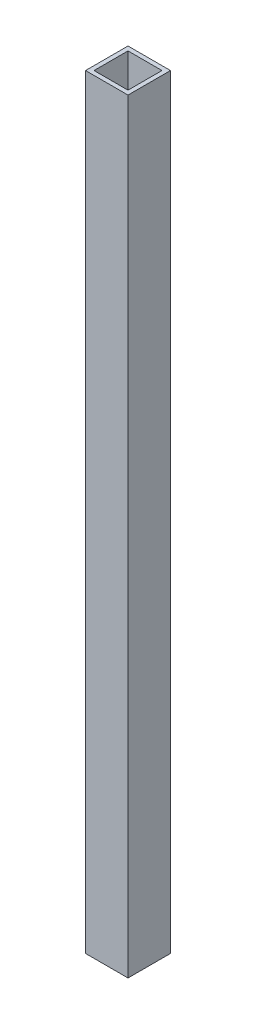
ISO-10303-21;
HEADER;
FILE_DESCRIPTION(('STEP AP214'),'2;1');
FILE_NAME('part.step','',(''),(''),'','','');
FILE_SCHEMA(('AUTOMOTIVE_DESIGN { 1 0 10303 214 1 1 1 1 }'));
ENDSEC;
DATA;
#1=APPLICATION_CONTEXT('core data for automotive mechanical design processes');
#2=APPLICATION_PROTOCOL_DEFINITION('international standard','automotive_design',2000,#1);
#3=PRODUCT_CONTEXT('',#1,'mechanical');
#4=PRODUCT('Part','Part','',(#3));
#5=PRODUCT_RELATED_PRODUCT_CATEGORY('part','',(#4));
#6=PRODUCT_DEFINITION_FORMATION('','',#4);
#7=PRODUCT_DEFINITION_CONTEXT('part definition',#1,'design');
#8=PRODUCT_DEFINITION('design','',#6,#7);
#9=PRODUCT_DEFINITION_SHAPE('','',#8);
#10=(LENGTH_UNIT() NAMED_UNIT(*) SI_UNIT(.MILLI.,.METRE.));
#11=(NAMED_UNIT(*) PLANE_ANGLE_UNIT() SI_UNIT($,.RADIAN.));
#12=(NAMED_UNIT(*) SI_UNIT($,.STERADIAN.) SOLID_ANGLE_UNIT());
#13=UNCERTAINTY_MEASURE_WITH_UNIT(LENGTH_MEASURE(1.E-05),#10,'distance_accuracy_value','');
#14=(GEOMETRIC_REPRESENTATION_CONTEXT(3) GLOBAL_UNCERTAINTY_ASSIGNED_CONTEXT((#13)) GLOBAL_UNIT_ASSIGNED_CONTEXT((#10,
#11,#12)) REPRESENTATION_CONTEXT('',''));
#15=CARTESIAN_POINT('',(0.,0.,0.));
#16=DIRECTION('',(0.,0.,1.));
#17=DIRECTION('',(1.,0.,0.));
#18=AXIS2_PLACEMENT_3D('',#15,#16,#17);
#19=CARTESIAN_POINT('',(0.,180.,0.));
#20=DIRECTION('',(0.,1.,0.));
#21=DIRECTION('',(0.,0.,1.));
#22=AXIS2_PLACEMENT_3D('',#19,#20,#21);
#23=PLANE('',#22);
#24=DIRECTION('',(0.,0.,-1.));
#25=VECTOR('',#24,1.);
#26=CARTESIAN_POINT('',(5.,180.,-5.));
#27=LINE('',#26,#25);
#28=CARTESIAN_POINT('',(5.,180.,5.));
#29=VERTEX_POINT('',#28);
#30=CARTESIAN_POINT('',(5.,180.,-5.));
#31=VERTEX_POINT('',#30);
#32=EDGE_CURVE('E133',#29,#31,#27,.T.);
#33=ORIENTED_EDGE('',*,*,#32,.T.);
#34=DIRECTION('',(-1.,0.,0.));
#35=VECTOR('',#34,1.);
#36=CARTESIAN_POINT('',(-5.,180.,-5.));
#37=LINE('',#36,#35);
#38=CARTESIAN_POINT('',(-5.,180.,-5.));
#39=VERTEX_POINT('',#38);
#40=EDGE_CURVE('E136',#31,#39,#37,.T.);
#41=ORIENTED_EDGE('',*,*,#40,.T.);
#42=DIRECTION('',(0.,0.,1.));
#43=VECTOR('',#42,1.);
#44=CARTESIAN_POINT('',(-5.,180.,-5.));
#45=LINE('',#44,#43);
#46=CARTESIAN_POINT('',(-5.,180.,5.));
#47=VERTEX_POINT('',#46);
#48=EDGE_CURVE('E139',#39,#47,#45,.T.);
#49=ORIENTED_EDGE('',*,*,#48,.T.);
#50=DIRECTION('',(1.,0.,0.));
#51=VECTOR('',#50,1.);
#52=CARTESIAN_POINT('',(-5.,180.,5.));
#53=LINE('',#52,#51);
#54=EDGE_CURVE('E141',#47,#29,#53,.T.);
#55=ORIENTED_EDGE('',*,*,#54,.T.);
#56=EDGE_LOOP('',(#33,#41,#49,#55));
#57=FACE_BOUND('',#56,.T.);
#58=DIRECTION('',(-1.,0.,0.));
#59=VECTOR('',#58,1.);
#60=CARTESIAN_POINT('',(-4.,180.,-4.));
#61=LINE('',#60,#59);
#62=CARTESIAN_POINT('',(4.,180.,-4.));
#63=VERTEX_POINT('',#62);
#64=CARTESIAN_POINT('',(-4.,180.,-4.));
#65=VERTEX_POINT('',#64);
#66=EDGE_CURVE('E105',#63,#65,#61,.T.);
#67=ORIENTED_EDGE('',*,*,#66,.F.);
#68=DIRECTION('',(0.,0.,-1.));
#69=VECTOR('',#68,1.);
#70=CARTESIAN_POINT('',(4.,180.,-4.));
#71=LINE('',#70,#69);
#72=CARTESIAN_POINT('',(4.,180.,4.));
#73=VERTEX_POINT('',#72);
#74=EDGE_CURVE('E97',#73,#63,#71,.T.);
#75=ORIENTED_EDGE('',*,*,#74,.F.);
#76=DIRECTION('',(1.,0.,0.));
#77=VECTOR('',#76,1.);
#78=CARTESIAN_POINT('',(-4.,180.,4.));
#79=LINE('',#78,#77);
#80=CARTESIAN_POINT('',(-4.,180.,4.));
#81=VERTEX_POINT('',#80);
#82=EDGE_CURVE('E119',#81,#73,#79,.T.);
#83=ORIENTED_EDGE('',*,*,#82,.F.);
#84=DIRECTION('',(0.,0.,1.));
#85=VECTOR('',#84,1.);
#86=CARTESIAN_POINT('',(-4.,180.,-4.));
#87=LINE('',#86,#85);
#88=EDGE_CURVE('E117',#65,#81,#87,.T.);
#89=ORIENTED_EDGE('',*,*,#88,.F.);
#90=EDGE_LOOP('',(#67,#75,#83,#89));
#91=FACE_BOUND('',#90,.T.);
#92=ADVANCED_FACE('F32',(#57,#91),#23,.T.);
#93=CARTESIAN_POINT('',(0.,0.,0.));
#94=DIRECTION('',(0.,1.,0.));
#95=DIRECTION('',(0.,0.,1.));
#96=AXIS2_PLACEMENT_3D('',#93,#94,#95);
#97=PLANE('',#96);
#98=DIRECTION('',(0.,0.,-1.));
#99=VECTOR('',#98,1.);
#100=CARTESIAN_POINT('',(5.,0.,-5.));
#101=LINE('',#100,#99);
#102=CARTESIAN_POINT('',(5.,0.,5.));
#103=VERTEX_POINT('',#102);
#104=CARTESIAN_POINT('',(5.,0.,-5.));
#105=VERTEX_POINT('',#104);
#106=EDGE_CURVE('E113',#103,#105,#101,.T.);
#107=ORIENTED_EDGE('',*,*,#106,.F.);
#108=DIRECTION('',(1.,0.,0.));
#109=VECTOR('',#108,1.);
#110=CARTESIAN_POINT('',(-5.,0.,5.));
#111=LINE('',#110,#109);
#112=CARTESIAN_POINT('',(-5.,0.,5.));
#113=VERTEX_POINT('',#112);
#114=EDGE_CURVE('E137',#113,#103,#111,.T.);
#115=ORIENTED_EDGE('',*,*,#114,.F.);
#116=DIRECTION('',(0.,0.,1.));
#117=VECTOR('',#116,1.);
#118=CARTESIAN_POINT('',(-5.,0.,-5.));
#119=LINE('',#118,#117);
#120=CARTESIAN_POINT('',(-5.,0.,-5.));
#121=VERTEX_POINT('',#120);
#122=EDGE_CURVE('E148',#121,#113,#119,.T.);
#123=ORIENTED_EDGE('',*,*,#122,.F.);
#124=DIRECTION('',(-1.,0.,0.));
#125=VECTOR('',#124,1.);
#126=CARTESIAN_POINT('',(-5.,0.,-5.));
#127=LINE('',#126,#125);
#128=EDGE_CURVE('E146',#105,#121,#127,.T.);
#129=ORIENTED_EDGE('',*,*,#128,.F.);
#130=EDGE_LOOP('',(#107,#115,#123,#129));
#131=FACE_BOUND('',#130,.T.);
#132=DIRECTION('',(0.,0.,-1.));
#133=VECTOR('',#132,1.);
#134=CARTESIAN_POINT('',(4.,0.,-4.));
#135=LINE('',#134,#133);
#136=CARTESIAN_POINT('',(4.,0.,4.));
#137=VERTEX_POINT('',#136);
#138=CARTESIAN_POINT('',(4.,0.,-4.));
#139=VERTEX_POINT('',#138);
#140=EDGE_CURVE('E55',#137,#139,#135,.T.);
#141=ORIENTED_EDGE('',*,*,#140,.T.);
#142=DIRECTION('',(-1.,0.,0.));
#143=VECTOR('',#142,1.);
#144=CARTESIAN_POINT('',(-4.,0.,-4.));
#145=LINE('',#144,#143);
#146=CARTESIAN_POINT('',(-4.,0.,-4.));
#147=VERTEX_POINT('',#146);
#148=EDGE_CURVE('E112',#139,#147,#145,.T.);
#149=ORIENTED_EDGE('',*,*,#148,.T.);
#150=DIRECTION('',(0.,0.,1.));
#151=VECTOR('',#150,1.);
#152=CARTESIAN_POINT('',(-4.,0.,-4.));
#153=LINE('',#152,#151);
#154=CARTESIAN_POINT('',(-4.,0.,4.));
#155=VERTEX_POINT('',#154);
#156=EDGE_CURVE('E125',#147,#155,#153,.T.);
#157=ORIENTED_EDGE('',*,*,#156,.T.);
#158=DIRECTION('',(1.,0.,0.));
#159=VECTOR('',#158,1.);
#160=CARTESIAN_POINT('',(-4.,0.,4.));
#161=LINE('',#160,#159);
#162=EDGE_CURVE('E106',#155,#137,#161,.T.);
#163=ORIENTED_EDGE('',*,*,#162,.T.);
#164=EDGE_LOOP('',(#141,#149,#157,#163));
#165=FACE_BOUND('',#164,.T.);
#166=ADVANCED_FACE('F166',(#131,#165),#97,.F.);
#167=CARTESIAN_POINT('',(5.,180.,-5.));
#168=DIRECTION('',(-1.,0.,0.));
#169=DIRECTION('',(0.,0.,1.));
#170=AXIS2_PLACEMENT_3D('',#167,#168,#169);
#171=PLANE('',#170);
#172=ORIENTED_EDGE('',*,*,#106,.T.);
#173=DIRECTION('',(0.,-1.,0.));
#174=VECTOR('',#173,1.);
#175=CARTESIAN_POINT('',(5.,180.,-5.));
#176=LINE('',#175,#174);
#177=EDGE_CURVE('E11',#31,#105,#176,.T.);
#178=ORIENTED_EDGE('',*,*,#177,.F.);
#179=ORIENTED_EDGE('',*,*,#32,.F.);
#180=DIRECTION('',(0.,-1.,0.));
#181=VECTOR('',#180,1.);
#182=CARTESIAN_POINT('',(5.,180.,5.));
#183=LINE('',#182,#181);
#184=EDGE_CURVE('E143',#29,#103,#183,.T.);
#185=ORIENTED_EDGE('',*,*,#184,.T.);
#186=EDGE_LOOP('',(#172,#178,#179,#185));
#187=FACE_BOUND('',#186,.T.);
#188=ADVANCED_FACE('F34',(#187),#171,.F.);
#189=CARTESIAN_POINT('',(-5.,180.,-5.));
#190=DIRECTION('',(0.,0.,1.));
#191=DIRECTION('',(1.,0.,0.));
#192=AXIS2_PLACEMENT_3D('',#189,#190,#191);
#193=PLANE('',#192);
#194=ORIENTED_EDGE('',*,*,#128,.T.);
#195=DIRECTION('',(0.,-1.,0.));
#196=VECTOR('',#195,1.);
#197=CARTESIAN_POINT('',(-5.,180.,-5.));
#198=LINE('',#197,#196);
#199=EDGE_CURVE('E40',#39,#121,#198,.T.);
#200=ORIENTED_EDGE('',*,*,#199,.F.);
#201=ORIENTED_EDGE('',*,*,#40,.F.);
#202=ORIENTED_EDGE('',*,*,#177,.T.);
#203=EDGE_LOOP('',(#194,#200,#201,#202));
#204=FACE_BOUND('',#203,.T.);
#205=ADVANCED_FACE('F176',(#204),#193,.F.);
#206=CARTESIAN_POINT('',(-5.,180.,-5.));
#207=DIRECTION('',(1.,0.,0.));
#208=DIRECTION('',(0.,0.,-1.));
#209=AXIS2_PLACEMENT_3D('',#206,#207,#208);
#210=PLANE('',#209);
#211=ORIENTED_EDGE('',*,*,#122,.T.);
#212=DIRECTION('',(0.,-1.,0.));
#213=VECTOR('',#212,1.);
#214=CARTESIAN_POINT('',(-5.,180.,5.));
#215=LINE('',#214,#213);
#216=EDGE_CURVE('E153',#47,#113,#215,.T.);
#217=ORIENTED_EDGE('',*,*,#216,.F.);
#218=ORIENTED_EDGE('',*,*,#48,.F.);
#219=ORIENTED_EDGE('',*,*,#199,.T.);
#220=EDGE_LOOP('',(#211,#217,#218,#219));
#221=FACE_BOUND('',#220,.T.);
#222=ADVANCED_FACE('F160',(#221),#210,.F.);
#223=CARTESIAN_POINT('',(-5.,180.,5.));
#224=DIRECTION('',(0.,0.,-1.));
#225=DIRECTION('',(-1.,0.,0.));
#226=AXIS2_PLACEMENT_3D('',#223,#224,#225);
#227=PLANE('',#226);
#228=ORIENTED_EDGE('',*,*,#114,.T.);
#229=ORIENTED_EDGE('',*,*,#184,.F.);
#230=ORIENTED_EDGE('',*,*,#54,.F.);
#231=ORIENTED_EDGE('',*,*,#216,.T.);
#232=EDGE_LOOP('',(#228,#229,#230,#231));
#233=FACE_BOUND('',#232,.T.);
#234=ADVANCED_FACE('F170',(#233),#227,.F.);
#235=CARTESIAN_POINT('',(4.,180.,-4.));
#236=DIRECTION('',(-1.,0.,0.));
#237=DIRECTION('',(0.,0.,1.));
#238=AXIS2_PLACEMENT_3D('',#235,#236,#237);
#239=PLANE('',#238);
#240=ORIENTED_EDGE('',*,*,#140,.F.);
#241=DIRECTION('',(0.,-1.,0.));
#242=VECTOR('',#241,1.);
#243=CARTESIAN_POINT('',(4.,180.,4.));
#244=LINE('',#243,#242);
#245=EDGE_CURVE('E101',#73,#137,#244,.T.);
#246=ORIENTED_EDGE('',*,*,#245,.F.);
#247=ORIENTED_EDGE('',*,*,#74,.T.);
#248=DIRECTION('',(0.,-1.,0.));
#249=VECTOR('',#248,1.);
#250=CARTESIAN_POINT('',(4.,180.,-4.));
#251=LINE('',#250,#249);
#252=EDGE_CURVE('E100',#63,#139,#251,.T.);
#253=ORIENTED_EDGE('',*,*,#252,.T.);
#254=EDGE_LOOP('',(#240,#246,#247,#253));
#255=FACE_BOUND('',#254,.T.);
#256=ADVANCED_FACE('F99',(#255),#239,.T.);
#257=CARTESIAN_POINT('',(-4.,180.,-4.));
#258=DIRECTION('',(0.,0.,1.));
#259=DIRECTION('',(1.,0.,0.));
#260=AXIS2_PLACEMENT_3D('',#257,#258,#259);
#261=PLANE('',#260);
#262=ORIENTED_EDGE('',*,*,#148,.F.);
#263=ORIENTED_EDGE('',*,*,#252,.F.);
#264=ORIENTED_EDGE('',*,*,#66,.T.);
#265=DIRECTION('',(0.,-1.,0.));
#266=VECTOR('',#265,1.);
#267=CARTESIAN_POINT('',(-4.,180.,-4.));
#268=LINE('',#267,#266);
#269=EDGE_CURVE('E114',#65,#147,#268,.T.);
#270=ORIENTED_EDGE('',*,*,#269,.T.);
#271=EDGE_LOOP('',(#262,#263,#264,#270));
#272=FACE_BOUND('',#271,.T.);
#273=ADVANCED_FACE('F109',(#272),#261,.T.);
#274=CARTESIAN_POINT('',(-4.,180.,-4.));
#275=DIRECTION('',(1.,0.,0.));
#276=DIRECTION('',(0.,0.,-1.));
#277=AXIS2_PLACEMENT_3D('',#274,#275,#276);
#278=PLANE('',#277);
#279=ORIENTED_EDGE('',*,*,#156,.F.);
#280=ORIENTED_EDGE('',*,*,#269,.F.);
#281=ORIENTED_EDGE('',*,*,#88,.T.);
#282=DIRECTION('',(0.,-1.,0.));
#283=VECTOR('',#282,1.);
#284=CARTESIAN_POINT('',(-4.,180.,4.));
#285=LINE('',#284,#283);
#286=EDGE_CURVE('E47',#81,#155,#285,.T.);
#287=ORIENTED_EDGE('',*,*,#286,.T.);
#288=EDGE_LOOP('',(#279,#280,#281,#287));
#289=FACE_BOUND('',#288,.T.);
#290=ADVANCED_FACE('F199',(#289),#278,.T.);
#291=CARTESIAN_POINT('',(-4.,180.,4.));
#292=DIRECTION('',(0.,0.,-1.));
#293=DIRECTION('',(-1.,0.,0.));
#294=AXIS2_PLACEMENT_3D('',#291,#292,#293);
#295=PLANE('',#294);
#296=ORIENTED_EDGE('',*,*,#162,.F.);
#297=ORIENTED_EDGE('',*,*,#286,.F.);
#298=ORIENTED_EDGE('',*,*,#82,.T.);
#299=ORIENTED_EDGE('',*,*,#245,.T.);
#300=EDGE_LOOP('',(#296,#297,#298,#299));
#301=FACE_BOUND('',#300,.T.);
#302=ADVANCED_FACE('F203',(#301),#295,.T.);
#303=CLOSED_SHELL('',(#92,#166,#188,#205,#222,#234,#256,#273,#290,#302));
#304=MANIFOLD_SOLID_BREP('B2',#303);
#305=ADVANCED_BREP_SHAPE_REPRESENTATION('',(#18,#304),#14);
#306=SHAPE_DEFINITION_REPRESENTATION(#9,#305);
ENDSEC;
END-ISO-10303-21;
